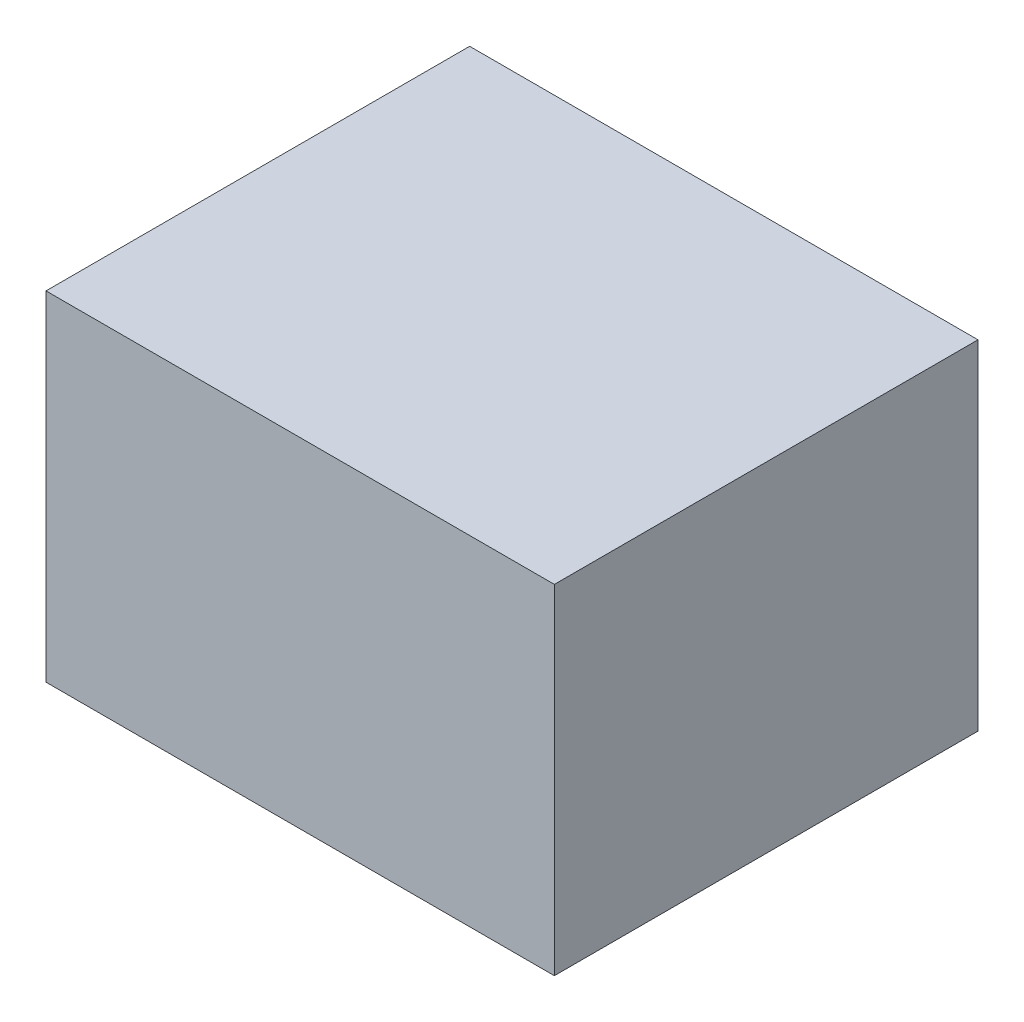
ISO-10303-21;
HEADER;
FILE_DESCRIPTION(('STEP AP214'),'2;1');
FILE_NAME('part.step','',(''),(''),'','','');
FILE_SCHEMA(('AUTOMOTIVE_DESIGN { 1 0 10303 214 1 1 1 1 }'));
ENDSEC;
DATA;
#1=APPLICATION_CONTEXT('core data for automotive mechanical design processes');
#2=APPLICATION_PROTOCOL_DEFINITION('international standard','automotive_design',2000,#1);
#3=PRODUCT_CONTEXT('',#1,'mechanical');
#4=PRODUCT('Part','Part','',(#3));
#5=PRODUCT_RELATED_PRODUCT_CATEGORY('part','',(#4));
#6=PRODUCT_DEFINITION_FORMATION('','',#4);
#7=PRODUCT_DEFINITION_CONTEXT('part definition',#1,'design');
#8=PRODUCT_DEFINITION('design','',#6,#7);
#9=PRODUCT_DEFINITION_SHAPE('','',#8);
#10=(LENGTH_UNIT() NAMED_UNIT(*) SI_UNIT(.MILLI.,.METRE.));
#11=(NAMED_UNIT(*) PLANE_ANGLE_UNIT() SI_UNIT($,.RADIAN.));
#12=(NAMED_UNIT(*) SI_UNIT($,.STERADIAN.) SOLID_ANGLE_UNIT());
#13=UNCERTAINTY_MEASURE_WITH_UNIT(LENGTH_MEASURE(1.E-05),#10,'distance_accuracy_value','');
#14=(GEOMETRIC_REPRESENTATION_CONTEXT(3) GLOBAL_UNCERTAINTY_ASSIGNED_CONTEXT((#13)) GLOBAL_UNIT_ASSIGNED_CONTEXT((#10,
#11,#12)) REPRESENTATION_CONTEXT('',''));
#15=CARTESIAN_POINT('',(0.,0.,0.));
#16=DIRECTION('',(0.,0.,1.));
#17=DIRECTION('',(1.,0.,0.));
#18=AXIS2_PLACEMENT_3D('',#15,#16,#17);
#19=CARTESIAN_POINT('',(0.,0.,25.));
#20=DIRECTION('',(0.,1.,0.));
#21=DIRECTION('',(0.,0.,1.));
#22=AXIS2_PLACEMENT_3D('',#19,#20,#21);
#23=PLANE('',#22);
#24=DIRECTION('',(1.,0.,0.));
#25=VECTOR('',#24,1.);
#26=CARTESIAN_POINT('',(0.,0.,-25.));
#27=LINE('',#26,#25);
#28=CARTESIAN_POINT('',(0.,0.,-25.));
#29=VERTEX_POINT('',#28);
#30=CARTESIAN_POINT('',(60.,0.,-25.));
#31=VERTEX_POINT('',#30);
#32=EDGE_CURVE('E96',#29,#31,#27,.T.);
#33=ORIENTED_EDGE('',*,*,#32,.T.);
#34=DIRECTION('',(0.,0.,-1.));
#35=VECTOR('',#34,1.);
#36=CARTESIAN_POINT('',(60.,0.,25.));
#37=LINE('',#36,#35);
#38=CARTESIAN_POINT('',(60.,0.,25.));
#39=VERTEX_POINT('',#38);
#40=EDGE_CURVE('E94',#39,#31,#37,.T.);
#41=ORIENTED_EDGE('',*,*,#40,.F.);
#42=DIRECTION('',(1.,0.,0.));
#43=VECTOR('',#42,1.);
#44=CARTESIAN_POINT('',(0.,0.,25.));
#45=LINE('',#44,#43);
#46=CARTESIAN_POINT('',(0.,0.,25.));
#47=VERTEX_POINT('',#46);
#48=EDGE_CURVE('E86',#47,#39,#45,.T.);
#49=ORIENTED_EDGE('',*,*,#48,.F.);
#50=DIRECTION('',(0.,0.,-1.));
#51=VECTOR('',#50,1.);
#52=CARTESIAN_POINT('',(0.,0.,25.));
#53=LINE('',#52,#51);
#54=EDGE_CURVE('E97',#47,#29,#53,.T.);
#55=ORIENTED_EDGE('',*,*,#54,.T.);
#56=EDGE_LOOP('',(#33,#41,#49,#55));
#57=FACE_BOUND('',#56,.T.);
#58=CARTESIAN_POINT('',(6.,0.,18.));
#59=DIRECTION('',(0.,1.,0.));
#60=DIRECTION('',(0.,0.,1.));
#61=AXIS2_PLACEMENT_3D('',#58,#59,#60);
#62=CIRCLE('',#61,2.5);
#63=CARTESIAN_POINT('',(6.,0.,20.5));
#64=VERTEX_POINT('',#63);
#65=EDGE_CURVE('E115',#64,#64,#62,.F.);
#66=ORIENTED_EDGE('',*,*,#65,.F.);
#67=EDGE_LOOP('',(#66));
#68=FACE_BOUND('',#67,.T.);
#69=CARTESIAN_POINT('',(6.,0.,-18.));
#70=DIRECTION('',(0.,1.,0.));
#71=DIRECTION('',(0.,0.,1.));
#72=AXIS2_PLACEMENT_3D('',#69,#70,#71);
#73=CIRCLE('',#72,2.5);
#74=CARTESIAN_POINT('',(6.,0.,-15.5));
#75=VERTEX_POINT('',#74);
#76=EDGE_CURVE('E47',#75,#75,#73,.F.);
#77=ORIENTED_EDGE('',*,*,#76,.F.);
#78=EDGE_LOOP('',(#77));
#79=FACE_BOUND('',#78,.T.);
#80=CARTESIAN_POINT('',(55.,0.,0.));
#81=DIRECTION('',(0.,1.,0.));
#82=DIRECTION('',(0.,0.,1.));
#83=AXIS2_PLACEMENT_3D('',#80,#81,#82);
#84=CIRCLE('',#83,2.5);
#85=CARTESIAN_POINT('',(55.,0.,2.5));
#86=VERTEX_POINT('',#85);
#87=EDGE_CURVE('E11',#86,#86,#84,.F.);
#88=ORIENTED_EDGE('',*,*,#87,.F.);
#89=EDGE_LOOP('',(#88));
#90=FACE_BOUND('',#89,.T.);
#91=ADVANCED_FACE('F37',(#57,#68,#79,#90),#23,.F.);
#92=ORIENTED_EDGE('',*,*,#87,.T.);
#93=EDGE_LOOP('',(#92));
#94=FACE_BOUND('',#93,.T.);
#95=ADVANCED_FACE('F128',(#94),#23,.F.);
#96=ORIENTED_EDGE('',*,*,#76,.T.);
#97=EDGE_LOOP('',(#96));
#98=FACE_BOUND('',#97,.T.);
#99=ADVANCED_FACE('F124',(#98),#23,.F.);
#100=CARTESIAN_POINT('',(0.,0.,25.));
#101=DIRECTION('',(1.,0.,0.));
#102=DIRECTION('',(0.,0.,-1.));
#103=AXIS2_PLACEMENT_3D('',#100,#101,#102);
#104=PLANE('',#103);
#105=DIRECTION('',(0.,-1.,0.));
#106=VECTOR('',#105,1.);
#107=CARTESIAN_POINT('',(0.,0.,-25.));
#108=LINE('',#107,#106);
#109=CARTESIAN_POINT('',(0.,40.,-25.));
#110=VERTEX_POINT('',#109);
#111=EDGE_CURVE('E106',#110,#29,#108,.T.);
#112=ORIENTED_EDGE('',*,*,#111,.T.);
#113=ORIENTED_EDGE('',*,*,#54,.F.);
#114=DIRECTION('',(0.,-1.,0.));
#115=VECTOR('',#114,1.);
#116=CARTESIAN_POINT('',(0.,0.,25.));
#117=LINE('',#116,#115);
#118=CARTESIAN_POINT('',(0.,40.,25.));
#119=VERTEX_POINT('',#118);
#120=EDGE_CURVE('E91',#119,#47,#117,.T.);
#121=ORIENTED_EDGE('',*,*,#120,.F.);
#122=DIRECTION('',(0.,0.,-1.));
#123=VECTOR('',#122,1.);
#124=CARTESIAN_POINT('',(0.,40.,25.));
#125=LINE('',#124,#123);
#126=EDGE_CURVE('E102',#119,#110,#125,.T.);
#127=ORIENTED_EDGE('',*,*,#126,.T.);
#128=EDGE_LOOP('',(#112,#113,#121,#127));
#129=FACE_BOUND('',#128,.T.);
#130=ADVANCED_FACE('F39',(#129),#104,.F.);
#131=ORIENTED_EDGE('',*,*,#65,.T.);
#132=EDGE_LOOP('',(#131));
#133=FACE_BOUND('',#132,.T.);
#134=ADVANCED_FACE('F129',(#133),#23,.F.);
#135=CARTESIAN_POINT('',(60.,0.,25.));
#136=DIRECTION('',(-1.,0.,0.));
#137=DIRECTION('',(0.,-1.,0.));
#138=AXIS2_PLACEMENT_3D('',#135,#136,#137);
#139=PLANE('',#138);
#140=DIRECTION('',(0.,1.,0.));
#141=VECTOR('',#140,1.);
#142=CARTESIAN_POINT('',(60.,0.,-25.));
#143=LINE('',#142,#141);
#144=CARTESIAN_POINT('',(60.,40.,-25.));
#145=VERTEX_POINT('',#144);
#146=EDGE_CURVE('E72',#31,#145,#143,.T.);
#147=ORIENTED_EDGE('',*,*,#146,.T.);
#148=DIRECTION('',(0.,0.,-1.));
#149=VECTOR('',#148,1.);
#150=CARTESIAN_POINT('',(60.,40.,25.));
#151=LINE('',#150,#149);
#152=CARTESIAN_POINT('',(60.,40.,25.));
#153=VERTEX_POINT('',#152);
#154=EDGE_CURVE('E98',#153,#145,#151,.T.);
#155=ORIENTED_EDGE('',*,*,#154,.F.);
#156=DIRECTION('',(0.,1.,0.));
#157=VECTOR('',#156,1.);
#158=CARTESIAN_POINT('',(60.,0.,25.));
#159=LINE('',#158,#157);
#160=EDGE_CURVE('E89',#39,#153,#159,.T.);
#161=ORIENTED_EDGE('',*,*,#160,.F.);
#162=ORIENTED_EDGE('',*,*,#40,.T.);
#163=EDGE_LOOP('',(#147,#155,#161,#162));
#164=FACE_BOUND('',#163,.T.);
#165=ADVANCED_FACE('F100',(#164),#139,.F.);
#166=CARTESIAN_POINT('',(0.,40.,25.));
#167=DIRECTION('',(0.,-1.,0.));
#168=DIRECTION('',(0.,0.,-1.));
#169=AXIS2_PLACEMENT_3D('',#166,#167,#168);
#170=PLANE('',#169);
#171=DIRECTION('',(-1.,0.,0.));
#172=VECTOR('',#171,1.);
#173=CARTESIAN_POINT('',(0.,40.,-25.));
#174=LINE('',#173,#172);
#175=EDGE_CURVE('E78',#145,#110,#174,.T.);
#176=ORIENTED_EDGE('',*,*,#175,.T.);
#177=ORIENTED_EDGE('',*,*,#126,.F.);
#178=DIRECTION('',(-1.,0.,0.));
#179=VECTOR('',#178,1.);
#180=CARTESIAN_POINT('',(0.,40.,25.));
#181=LINE('',#180,#179);
#182=EDGE_CURVE('E55',#153,#119,#181,.T.);
#183=ORIENTED_EDGE('',*,*,#182,.F.);
#184=ORIENTED_EDGE('',*,*,#154,.T.);
#185=EDGE_LOOP('',(#176,#177,#183,#184));
#186=FACE_BOUND('',#185,.T.);
#187=ADVANCED_FACE('F141',(#186),#170,.F.);
#188=CARTESIAN_POINT('',(0.,40.,25.));
#189=DIRECTION('',(0.,0.,-1.));
#190=DIRECTION('',(-1.,0.,0.));
#191=AXIS2_PLACEMENT_3D('',#188,#189,#190);
#192=PLANE('',#191);
#193=ORIENTED_EDGE('',*,*,#120,.T.);
#194=ORIENTED_EDGE('',*,*,#48,.T.);
#195=ORIENTED_EDGE('',*,*,#160,.T.);
#196=ORIENTED_EDGE('',*,*,#182,.T.);
#197=EDGE_LOOP('',(#193,#194,#195,#196));
#198=FACE_BOUND('',#197,.T.);
#199=ADVANCED_FACE('F87',(#198),#192,.F.);
#200=CARTESIAN_POINT('',(0.,40.,-25.));
#201=DIRECTION('',(0.,0.,-1.));
#202=DIRECTION('',(-1.,0.,0.));
#203=AXIS2_PLACEMENT_3D('',#200,#201,#202);
#204=PLANE('',#203);
#205=ORIENTED_EDGE('',*,*,#111,.F.);
#206=ORIENTED_EDGE('',*,*,#175,.F.);
#207=ORIENTED_EDGE('',*,*,#146,.F.);
#208=ORIENTED_EDGE('',*,*,#32,.F.);
#209=EDGE_LOOP('',(#205,#206,#207,#208));
#210=FACE_BOUND('',#209,.T.);
#211=ADVANCED_FACE('F144',(#210),#204,.T.);
#212=CLOSED_SHELL('',(#91,#95,#99,#130,#134,#165,#187,#199,#211));
#213=MANIFOLD_SOLID_BREP('B2',#212);
#214=ADVANCED_BREP_SHAPE_REPRESENTATION('',(#18,#213),#14);
#215=SHAPE_DEFINITION_REPRESENTATION(#9,#214);
ENDSEC;
END-ISO-10303-21;
